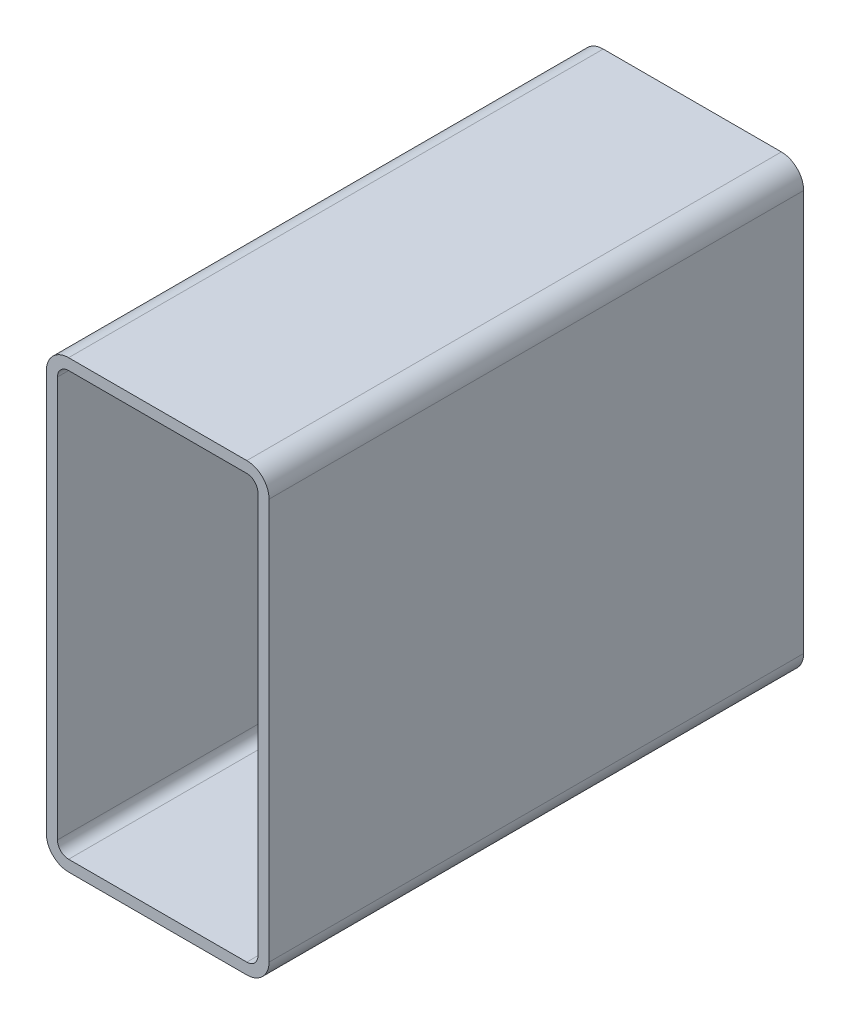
ISO-10303-21;
HEADER;
FILE_DESCRIPTION(('STEP AP214'),'2;1');
FILE_NAME('part.step','',(''),(''),'','','');
FILE_SCHEMA(('AUTOMOTIVE_DESIGN { 1 0 10303 214 1 1 1 1 }'));
ENDSEC;
DATA;
#1=APPLICATION_CONTEXT('core data for automotive mechanical design processes');
#2=APPLICATION_PROTOCOL_DEFINITION('international standard','automotive_design',2000,#1);
#3=PRODUCT_CONTEXT('',#1,'mechanical');
#4=PRODUCT('Part','Part','',(#3));
#5=PRODUCT_RELATED_PRODUCT_CATEGORY('part','',(#4));
#6=PRODUCT_DEFINITION_FORMATION('','',#4);
#7=PRODUCT_DEFINITION_CONTEXT('part definition',#1,'design');
#8=PRODUCT_DEFINITION('design','',#6,#7);
#9=PRODUCT_DEFINITION_SHAPE('','',#8);
#10=(LENGTH_UNIT() NAMED_UNIT(*) SI_UNIT(.MILLI.,.METRE.));
#11=(NAMED_UNIT(*) PLANE_ANGLE_UNIT() SI_UNIT($,.RADIAN.));
#12=(NAMED_UNIT(*) SI_UNIT($,.STERADIAN.) SOLID_ANGLE_UNIT());
#13=UNCERTAINTY_MEASURE_WITH_UNIT(LENGTH_MEASURE(1.E-05),#10,'distance_accuracy_value','');
#14=(GEOMETRIC_REPRESENTATION_CONTEXT(3) GLOBAL_UNCERTAINTY_ASSIGNED_CONTEXT((#13)) GLOBAL_UNIT_ASSIGNED_CONTEXT((#10,
#11,#12)) REPRESENTATION_CONTEXT('',''));
#15=CARTESIAN_POINT('',(0.,0.,0.));
#16=DIRECTION('',(0.,0.,1.));
#17=DIRECTION('',(1.,0.,0.));
#18=AXIS2_PLACEMENT_3D('',#15,#16,#17);
#19=CARTESIAN_POINT('',(13.5612396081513,243.220313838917,304.8));
#20=DIRECTION('',(0.,0.,1.));
#21=DIRECTION('',(1.,0.,0.));
#22=AXIS2_PLACEMENT_3D('',#19,#20,#21);
#23=PLANE('',#22);
#24=CARTESIAN_POINT('',(13.5612396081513,243.220313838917,304.8));
#25=DIRECTION('',(0.,0.,1.));
#26=DIRECTION('',(1.,0.,0.));
#27=AXIS2_PLACEMENT_3D('',#24,#25,#26);
#28=CIRCLE('',#27,12.7);
#29=CARTESIAN_POINT('',(13.5612396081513,255.920313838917,304.8));
#30=VERTEX_POINT('',#29);
#31=CARTESIAN_POINT('',(0.8612396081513,243.220313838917,304.8));
#32=VERTEX_POINT('',#31);
#33=EDGE_CURVE('E211',#30,#32,#28,.T.);
#34=ORIENTED_EDGE('',*,*,#33,.T.);
#35=DIRECTION('',(0.,-1.,0.));
#36=VECTOR('',#35,1.);
#37=CARTESIAN_POINT('',(0.8612396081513,14.6203138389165,304.8));
#38=LINE('',#37,#36);
#39=CARTESIAN_POINT('',(0.861239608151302,14.6203138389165,304.8));
#40=VERTEX_POINT('',#39);
#41=EDGE_CURVE('E214',#32,#40,#38,.T.);
#42=ORIENTED_EDGE('',*,*,#41,.T.);
#43=CARTESIAN_POINT('',(13.5612396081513,14.6203138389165,304.8));
#44=DIRECTION('',(0.,0.,1.));
#45=DIRECTION('',(1.,0.,0.));
#46=AXIS2_PLACEMENT_3D('',#43,#44,#45);
#47=CIRCLE('',#46,12.7);
#48=CARTESIAN_POINT('',(13.5612396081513,1.92031383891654,304.8));
#49=VERTEX_POINT('',#48);
#50=EDGE_CURVE('E217',#40,#49,#47,.T.);
#51=ORIENTED_EDGE('',*,*,#50,.T.);
#52=DIRECTION('',(1.,0.,0.));
#53=VECTOR('',#52,1.);
#54=CARTESIAN_POINT('',(115.161239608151,1.92031383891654,304.8));
#55=LINE('',#54,#53);
#56=CARTESIAN_POINT('',(115.161239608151,1.92031383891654,304.8));
#57=VERTEX_POINT('',#56);
#58=EDGE_CURVE('E219',#49,#57,#55,.T.);
#59=ORIENTED_EDGE('',*,*,#58,.T.);
#60=CARTESIAN_POINT('',(115.161239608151,14.6203138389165,304.8));
#61=DIRECTION('',(0.,0.,1.));
#62=DIRECTION('',(1.,0.,0.));
#63=AXIS2_PLACEMENT_3D('',#60,#61,#62);
#64=CIRCLE('',#63,12.7);
#65=CARTESIAN_POINT('',(127.861239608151,14.6203138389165,304.8));
#66=VERTEX_POINT('',#65);
#67=EDGE_CURVE('E221',#57,#66,#64,.T.);
#68=ORIENTED_EDGE('',*,*,#67,.T.);
#69=DIRECTION('',(0.,1.,0.));
#70=VECTOR('',#69,1.);
#71=CARTESIAN_POINT('',(127.861239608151,243.220313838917,304.8));
#72=LINE('',#71,#70);
#73=CARTESIAN_POINT('',(127.861239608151,243.220313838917,304.8));
#74=VERTEX_POINT('',#73);
#75=EDGE_CURVE('E223',#66,#74,#72,.T.);
#76=ORIENTED_EDGE('',*,*,#75,.T.);
#77=CARTESIAN_POINT('',(115.161239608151,243.220313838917,304.8));
#78=DIRECTION('',(0.,0.,1.));
#79=DIRECTION('',(1.,0.,0.));
#80=AXIS2_PLACEMENT_3D('',#77,#78,#79);
#81=CIRCLE('',#80,12.7);
#82=CARTESIAN_POINT('',(115.161239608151,255.920313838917,304.8));
#83=VERTEX_POINT('',#82);
#84=EDGE_CURVE('E225',#74,#83,#81,.T.);
#85=ORIENTED_EDGE('',*,*,#84,.T.);
#86=DIRECTION('',(-1.,0.,0.));
#87=VECTOR('',#86,1.);
#88=CARTESIAN_POINT('',(13.5612396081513,255.920313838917,304.8));
#89=LINE('',#88,#87);
#90=EDGE_CURVE('E227',#83,#30,#89,.T.);
#91=ORIENTED_EDGE('',*,*,#90,.T.);
#92=EDGE_LOOP('',(#34,#42,#51,#59,#68,#76,#85,#91));
#93=FACE_BOUND('',#92,.T.);
#94=DIRECTION('',(0.,-1.,0.));
#95=VECTOR('',#94,1.);
#96=CARTESIAN_POINT('',(7.2112396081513,14.6203138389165,304.8));
#97=LINE('',#96,#95);
#98=CARTESIAN_POINT('',(7.2112396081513,243.220313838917,304.8));
#99=VERTEX_POINT('',#98);
#100=CARTESIAN_POINT('',(7.2112396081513,14.6203138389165,304.8));
#101=VERTEX_POINT('',#100);
#102=EDGE_CURVE('E154',#99,#101,#97,.T.);
#103=ORIENTED_EDGE('',*,*,#102,.F.);
#104=CARTESIAN_POINT('',(13.5612396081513,243.220313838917,304.8));
#105=DIRECTION('',(0.,0.,1.));
#106=DIRECTION('',(1.,0.,0.));
#107=AXIS2_PLACEMENT_3D('',#104,#105,#106);
#108=CIRCLE('',#107,6.35000000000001);
#109=CARTESIAN_POINT('',(13.5612396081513,249.570313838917,304.8));
#110=VERTEX_POINT('',#109);
#111=EDGE_CURVE('E146',#110,#99,#108,.T.);
#112=ORIENTED_EDGE('',*,*,#111,.F.);
#113=DIRECTION('',(-1.,0.,0.));
#114=VECTOR('',#113,1.);
#115=CARTESIAN_POINT('',(13.5612396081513,249.570313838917,304.8));
#116=LINE('',#115,#114);
#117=CARTESIAN_POINT('',(115.161239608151,249.570313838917,304.8));
#118=VERTEX_POINT('',#117);
#119=EDGE_CURVE('E179',#118,#110,#116,.T.);
#120=ORIENTED_EDGE('',*,*,#119,.F.);
#121=CARTESIAN_POINT('',(115.161239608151,243.220313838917,304.8));
#122=DIRECTION('',(0.,0.,1.));
#123=DIRECTION('',(1.,0.,0.));
#124=AXIS2_PLACEMENT_3D('',#121,#122,#123);
#125=CIRCLE('',#124,6.35000000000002);
#126=CARTESIAN_POINT('',(121.511239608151,243.220313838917,304.8));
#127=VERTEX_POINT('',#126);
#128=EDGE_CURVE('E177',#127,#118,#125,.T.);
#129=ORIENTED_EDGE('',*,*,#128,.F.);
#130=DIRECTION('',(0.,1.,0.));
#131=VECTOR('',#130,1.);
#132=CARTESIAN_POINT('',(121.511239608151,243.220313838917,304.8));
#133=LINE('',#132,#131);
#134=CARTESIAN_POINT('',(121.511239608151,14.6203138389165,304.8));
#135=VERTEX_POINT('',#134);
#136=EDGE_CURVE('E175',#135,#127,#133,.T.);
#137=ORIENTED_EDGE('',*,*,#136,.F.);
#138=CARTESIAN_POINT('',(115.161239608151,14.6203138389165,304.8));
#139=DIRECTION('',(0.,0.,1.));
#140=DIRECTION('',(1.,0.,0.));
#141=AXIS2_PLACEMENT_3D('',#138,#139,#140);
#142=CIRCLE('',#141,6.35000000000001);
#143=CARTESIAN_POINT('',(115.161239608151,8.27031383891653,304.8));
#144=VERTEX_POINT('',#143);
#145=EDGE_CURVE('E173',#144,#135,#142,.T.);
#146=ORIENTED_EDGE('',*,*,#145,.F.);
#147=DIRECTION('',(1.,0.,0.));
#148=VECTOR('',#147,1.);
#149=CARTESIAN_POINT('',(115.161239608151,8.27031383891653,304.8));
#150=LINE('',#149,#148);
#151=CARTESIAN_POINT('',(13.5612396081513,8.27031383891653,304.8));
#152=VERTEX_POINT('',#151);
#153=EDGE_CURVE('E169',#152,#144,#150,.T.);
#154=ORIENTED_EDGE('',*,*,#153,.F.);
#155=CARTESIAN_POINT('',(13.5612396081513,14.6203138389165,304.8));
#156=DIRECTION('',(0.,0.,1.));
#157=DIRECTION('',(1.,0.,0.));
#158=AXIS2_PLACEMENT_3D('',#155,#156,#157);
#159=CIRCLE('',#158,6.35);
#160=EDGE_CURVE('E167',#101,#152,#159,.T.);
#161=ORIENTED_EDGE('',*,*,#160,.F.);
#162=EDGE_LOOP('',(#103,#112,#120,#129,#137,#146,#154,#161));
#163=FACE_BOUND('',#162,.T.);
#164=ADVANCED_FACE('F33',(#93,#163),#23,.T.);
#165=CARTESIAN_POINT('',(13.5612396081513,243.220313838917,0.));
#166=DIRECTION('',(0.,0.,1.));
#167=DIRECTION('',(1.,0.,0.));
#168=AXIS2_PLACEMENT_3D('',#165,#166,#167);
#169=PLANE('',#168);
#170=CARTESIAN_POINT('',(13.5612396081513,243.220313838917,0.));
#171=DIRECTION('',(0.,0.,1.));
#172=DIRECTION('',(1.,0.,0.));
#173=AXIS2_PLACEMENT_3D('',#170,#171,#172);
#174=CIRCLE('',#173,12.7);
#175=CARTESIAN_POINT('',(13.5612396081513,255.920313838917,0.));
#176=VERTEX_POINT('',#175);
#177=CARTESIAN_POINT('',(0.8612396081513,243.220313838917,0.));
#178=VERTEX_POINT('',#177);
#179=EDGE_CURVE('E162',#176,#178,#174,.T.);
#180=ORIENTED_EDGE('',*,*,#179,.F.);
#181=DIRECTION('',(-1.,0.,0.));
#182=VECTOR('',#181,1.);
#183=CARTESIAN_POINT('',(13.5612396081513,255.920313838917,0.));
#184=LINE('',#183,#182);
#185=CARTESIAN_POINT('',(115.161239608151,255.920313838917,0.));
#186=VERTEX_POINT('',#185);
#187=EDGE_CURVE('E215',#186,#176,#184,.T.);
#188=ORIENTED_EDGE('',*,*,#187,.F.);
#189=CARTESIAN_POINT('',(115.161239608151,243.220313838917,0.));
#190=DIRECTION('',(0.,0.,1.));
#191=DIRECTION('',(1.,0.,0.));
#192=AXIS2_PLACEMENT_3D('',#189,#190,#191);
#193=CIRCLE('',#192,12.7);
#194=CARTESIAN_POINT('',(127.861239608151,243.220313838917,0.));
#195=VERTEX_POINT('',#194);
#196=EDGE_CURVE('E242',#195,#186,#193,.T.);
#197=ORIENTED_EDGE('',*,*,#196,.F.);
#198=DIRECTION('',(0.,1.,0.));
#199=VECTOR('',#198,1.);
#200=CARTESIAN_POINT('',(127.861239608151,243.220313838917,0.));
#201=LINE('',#200,#199);
#202=CARTESIAN_POINT('',(127.861239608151,14.6203138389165,0.));
#203=VERTEX_POINT('',#202);
#204=EDGE_CURVE('E240',#203,#195,#201,.T.);
#205=ORIENTED_EDGE('',*,*,#204,.F.);
#206=CARTESIAN_POINT('',(115.161239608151,14.6203138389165,0.));
#207=DIRECTION('',(0.,0.,1.));
#208=DIRECTION('',(1.,0.,0.));
#209=AXIS2_PLACEMENT_3D('',#206,#207,#208);
#210=CIRCLE('',#209,12.7);
#211=CARTESIAN_POINT('',(115.161239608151,1.92031383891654,0.));
#212=VERTEX_POINT('',#211);
#213=EDGE_CURVE('E238',#212,#203,#210,.T.);
#214=ORIENTED_EDGE('',*,*,#213,.F.);
#215=DIRECTION('',(1.,0.,0.));
#216=VECTOR('',#215,1.);
#217=CARTESIAN_POINT('',(115.161239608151,1.92031383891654,0.));
#218=LINE('',#217,#216);
#219=CARTESIAN_POINT('',(13.5612396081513,1.92031383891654,0.));
#220=VERTEX_POINT('',#219);
#221=EDGE_CURVE('E236',#220,#212,#218,.T.);
#222=ORIENTED_EDGE('',*,*,#221,.F.);
#223=CARTESIAN_POINT('',(13.5612396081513,14.6203138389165,0.));
#224=DIRECTION('',(0.,0.,1.));
#225=DIRECTION('',(1.,0.,0.));
#226=AXIS2_PLACEMENT_3D('',#223,#224,#225);
#227=CIRCLE('',#226,12.7);
#228=CARTESIAN_POINT('',(0.861239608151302,14.6203138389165,0.));
#229=VERTEX_POINT('',#228);
#230=EDGE_CURVE('E234',#229,#220,#227,.T.);
#231=ORIENTED_EDGE('',*,*,#230,.F.);
#232=DIRECTION('',(0.,-1.,0.));
#233=VECTOR('',#232,1.);
#234=CARTESIAN_POINT('',(0.8612396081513,14.6203138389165,0.));
#235=LINE('',#234,#233);
#236=EDGE_CURVE('E232',#178,#229,#235,.T.);
#237=ORIENTED_EDGE('',*,*,#236,.F.);
#238=EDGE_LOOP('',(#180,#188,#197,#205,#214,#222,#231,#237));
#239=FACE_BOUND('',#238,.T.);
#240=CARTESIAN_POINT('',(13.5612396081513,243.220313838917,0.));
#241=DIRECTION('',(0.,0.,1.));
#242=DIRECTION('',(1.,0.,0.));
#243=AXIS2_PLACEMENT_3D('',#240,#241,#242);
#244=CIRCLE('',#243,6.35000000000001);
#245=CARTESIAN_POINT('',(13.5612396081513,249.570313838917,0.));
#246=VERTEX_POINT('',#245);
#247=CARTESIAN_POINT('',(7.2112396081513,243.220313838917,0.));
#248=VERTEX_POINT('',#247);
#249=EDGE_CURVE('E56',#246,#248,#244,.T.);
#250=ORIENTED_EDGE('',*,*,#249,.T.);
#251=DIRECTION('',(0.,-1.,0.));
#252=VECTOR('',#251,1.);
#253=CARTESIAN_POINT('',(7.2112396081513,14.6203138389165,0.));
#254=LINE('',#253,#252);
#255=CARTESIAN_POINT('',(7.2112396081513,14.6203138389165,0.));
#256=VERTEX_POINT('',#255);
#257=EDGE_CURVE('E161',#248,#256,#254,.T.);
#258=ORIENTED_EDGE('',*,*,#257,.T.);
#259=CARTESIAN_POINT('',(13.5612396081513,14.6203138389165,0.));
#260=DIRECTION('',(0.,0.,1.));
#261=DIRECTION('',(1.,0.,0.));
#262=AXIS2_PLACEMENT_3D('',#259,#260,#261);
#263=CIRCLE('',#262,6.35);
#264=CARTESIAN_POINT('',(13.5612396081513,8.27031383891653,0.));
#265=VERTEX_POINT('',#264);
#266=EDGE_CURVE('E183',#256,#265,#263,.T.);
#267=ORIENTED_EDGE('',*,*,#266,.T.);
#268=DIRECTION('',(1.,0.,0.));
#269=VECTOR('',#268,1.);
#270=CARTESIAN_POINT('',(115.161239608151,8.27031383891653,0.));
#271=LINE('',#270,#269);
#272=CARTESIAN_POINT('',(115.161239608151,8.27031383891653,0.));
#273=VERTEX_POINT('',#272);
#274=EDGE_CURVE('E186',#265,#273,#271,.T.);
#275=ORIENTED_EDGE('',*,*,#274,.T.);
#276=CARTESIAN_POINT('',(115.161239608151,14.6203138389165,0.));
#277=DIRECTION('',(0.,0.,1.));
#278=DIRECTION('',(1.,0.,0.));
#279=AXIS2_PLACEMENT_3D('',#276,#277,#278);
#280=CIRCLE('',#279,6.35000000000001);
#281=CARTESIAN_POINT('',(121.511239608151,14.6203138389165,0.));
#282=VERTEX_POINT('',#281);
#283=EDGE_CURVE('E189',#273,#282,#280,.T.);
#284=ORIENTED_EDGE('',*,*,#283,.T.);
#285=DIRECTION('',(0.,1.,0.));
#286=VECTOR('',#285,1.);
#287=CARTESIAN_POINT('',(121.511239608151,243.220313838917,0.));
#288=LINE('',#287,#286);
#289=CARTESIAN_POINT('',(121.511239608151,243.220313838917,0.));
#290=VERTEX_POINT('',#289);
#291=EDGE_CURVE('E192',#282,#290,#288,.T.);
#292=ORIENTED_EDGE('',*,*,#291,.T.);
#293=CARTESIAN_POINT('',(115.161239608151,243.220313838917,0.));
#294=DIRECTION('',(0.,0.,1.));
#295=DIRECTION('',(1.,0.,0.));
#296=AXIS2_PLACEMENT_3D('',#293,#294,#295);
#297=CIRCLE('',#296,6.35000000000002);
#298=CARTESIAN_POINT('',(115.161239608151,249.570313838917,0.));
#299=VERTEX_POINT('',#298);
#300=EDGE_CURVE('E195',#290,#299,#297,.T.);
#301=ORIENTED_EDGE('',*,*,#300,.T.);
#302=DIRECTION('',(-1.,0.,0.));
#303=VECTOR('',#302,1.);
#304=CARTESIAN_POINT('',(13.5612396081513,249.570313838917,0.));
#305=LINE('',#304,#303);
#306=EDGE_CURVE('E155',#299,#246,#305,.T.);
#307=ORIENTED_EDGE('',*,*,#306,.T.);
#308=EDGE_LOOP('',(#250,#258,#267,#275,#284,#292,#301,#307));
#309=FACE_BOUND('',#308,.T.);
#310=ADVANCED_FACE('F272',(#239,#309),#169,.F.);
#311=CARTESIAN_POINT('',(13.5612396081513,243.220313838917,304.8));
#312=DIRECTION('',(0.,0.,-1.));
#313=DIRECTION('',(-1.,0.,0.));
#314=AXIS2_PLACEMENT_3D('',#311,#312,#313);
#315=CYLINDRICAL_SURFACE('',#314,12.7);
#316=ORIENTED_EDGE('',*,*,#179,.T.);
#317=DIRECTION('',(0.,0.,-1.));
#318=VECTOR('',#317,1.);
#319=CARTESIAN_POINT('',(0.8612396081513,243.220313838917,304.8));
#320=LINE('',#319,#318);
#321=EDGE_CURVE('E11',#32,#178,#320,.T.);
#322=ORIENTED_EDGE('',*,*,#321,.F.);
#323=ORIENTED_EDGE('',*,*,#33,.F.);
#324=DIRECTION('',(0.,0.,-1.));
#325=VECTOR('',#324,1.);
#326=CARTESIAN_POINT('',(13.5612396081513,255.920313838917,304.8));
#327=LINE('',#326,#325);
#328=EDGE_CURVE('E229',#30,#176,#327,.T.);
#329=ORIENTED_EDGE('',*,*,#328,.T.);
#330=EDGE_LOOP('',(#316,#322,#323,#329));
#331=FACE_BOUND('',#330,.T.);
#332=ADVANCED_FACE('F35',(#331),#315,.T.);
#333=CARTESIAN_POINT('',(0.8612396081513,14.6203138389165,304.8));
#334=DIRECTION('',(1.,0.,0.));
#335=DIRECTION('',(0.,0.,-1.));
#336=AXIS2_PLACEMENT_3D('',#333,#334,#335);
#337=PLANE('',#336);
#338=ORIENTED_EDGE('',*,*,#236,.T.);
#339=DIRECTION('',(0.,0.,-1.));
#340=VECTOR('',#339,1.);
#341=CARTESIAN_POINT('',(0.861239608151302,14.6203138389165,304.8));
#342=LINE('',#341,#340);
#343=EDGE_CURVE('E41',#40,#229,#342,.T.);
#344=ORIENTED_EDGE('',*,*,#343,.F.);
#345=ORIENTED_EDGE('',*,*,#41,.F.);
#346=ORIENTED_EDGE('',*,*,#321,.T.);
#347=EDGE_LOOP('',(#338,#344,#345,#346));
#348=FACE_BOUND('',#347,.T.);
#349=ADVANCED_FACE('F289',(#348),#337,.F.);
#350=CARTESIAN_POINT('',(13.5612396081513,14.6203138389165,304.8));
#351=DIRECTION('',(0.,0.,-1.));
#352=DIRECTION('',(-1.,0.,0.));
#353=AXIS2_PLACEMENT_3D('',#350,#351,#352);
#354=CYLINDRICAL_SURFACE('',#353,12.7);
#355=ORIENTED_EDGE('',*,*,#230,.T.);
#356=DIRECTION('',(0.,0.,-1.));
#357=VECTOR('',#356,1.);
#358=CARTESIAN_POINT('',(13.5612396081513,1.92031383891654,304.8));
#359=LINE('',#358,#357);
#360=EDGE_CURVE('E259',#49,#220,#359,.T.);
#361=ORIENTED_EDGE('',*,*,#360,.F.);
#362=ORIENTED_EDGE('',*,*,#50,.F.);
#363=ORIENTED_EDGE('',*,*,#343,.T.);
#364=EDGE_LOOP('',(#355,#361,#362,#363));
#365=FACE_BOUND('',#364,.T.);
#366=ADVANCED_FACE('F266',(#365),#354,.T.);
#367=CARTESIAN_POINT('',(115.161239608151,1.92031383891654,304.8));
#368=DIRECTION('',(0.,1.,0.));
#369=DIRECTION('',(0.,0.,1.));
#370=AXIS2_PLACEMENT_3D('',#367,#368,#369);
#371=PLANE('',#370);
#372=ORIENTED_EDGE('',*,*,#221,.T.);
#373=DIRECTION('',(0.,0.,-1.));
#374=VECTOR('',#373,1.);
#375=CARTESIAN_POINT('',(115.161239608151,1.92031383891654,304.8));
#376=LINE('',#375,#374);
#377=EDGE_CURVE('E256',#57,#212,#376,.T.);
#378=ORIENTED_EDGE('',*,*,#377,.F.);
#379=ORIENTED_EDGE('',*,*,#58,.F.);
#380=ORIENTED_EDGE('',*,*,#360,.T.);
#381=EDGE_LOOP('',(#372,#378,#379,#380));
#382=FACE_BOUND('',#381,.T.);
#383=ADVANCED_FACE('F278',(#382),#371,.F.);
#384=CARTESIAN_POINT('',(115.161239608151,14.6203138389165,304.8));
#385=DIRECTION('',(0.,0.,-1.));
#386=DIRECTION('',(-1.,0.,0.));
#387=AXIS2_PLACEMENT_3D('',#384,#385,#386);
#388=CYLINDRICAL_SURFACE('',#387,12.7);
#389=ORIENTED_EDGE('',*,*,#213,.T.);
#390=DIRECTION('',(0.,0.,-1.));
#391=VECTOR('',#390,1.);
#392=CARTESIAN_POINT('',(127.861239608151,14.6203138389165,304.8));
#393=LINE('',#392,#391);
#394=EDGE_CURVE('E253',#66,#203,#393,.T.);
#395=ORIENTED_EDGE('',*,*,#394,.F.);
#396=ORIENTED_EDGE('',*,*,#67,.F.);
#397=ORIENTED_EDGE('',*,*,#377,.T.);
#398=EDGE_LOOP('',(#389,#395,#396,#397));
#399=FACE_BOUND('',#398,.T.);
#400=ADVANCED_FACE('F282',(#399),#388,.T.);
#401=CARTESIAN_POINT('',(127.861239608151,243.220313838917,304.8));
#402=DIRECTION('',(-1.,0.,0.));
#403=DIRECTION('',(0.,0.,1.));
#404=AXIS2_PLACEMENT_3D('',#401,#402,#403);
#405=PLANE('',#404);
#406=ORIENTED_EDGE('',*,*,#204,.T.);
#407=DIRECTION('',(0.,0.,-1.));
#408=VECTOR('',#407,1.);
#409=CARTESIAN_POINT('',(127.861239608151,243.220313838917,304.8));
#410=LINE('',#409,#408);
#411=EDGE_CURVE('E250',#74,#195,#410,.T.);
#412=ORIENTED_EDGE('',*,*,#411,.F.);
#413=ORIENTED_EDGE('',*,*,#75,.F.);
#414=ORIENTED_EDGE('',*,*,#394,.T.);
#415=EDGE_LOOP('',(#406,#412,#413,#414));
#416=FACE_BOUND('',#415,.T.);
#417=ADVANCED_FACE('F302',(#416),#405,.F.);
#418=CARTESIAN_POINT('',(115.161239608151,243.220313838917,304.8));
#419=DIRECTION('',(0.,0.,-1.));
#420=DIRECTION('',(-1.,0.,0.));
#421=AXIS2_PLACEMENT_3D('',#418,#419,#420);
#422=CYLINDRICAL_SURFACE('',#421,12.7);
#423=ORIENTED_EDGE('',*,*,#196,.T.);
#424=DIRECTION('',(0.,0.,-1.));
#425=VECTOR('',#424,1.);
#426=CARTESIAN_POINT('',(115.161239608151,255.920313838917,304.8));
#427=LINE('',#426,#425);
#428=EDGE_CURVE('E247',#83,#186,#427,.T.);
#429=ORIENTED_EDGE('',*,*,#428,.F.);
#430=ORIENTED_EDGE('',*,*,#84,.F.);
#431=ORIENTED_EDGE('',*,*,#411,.T.);
#432=EDGE_LOOP('',(#423,#429,#430,#431));
#433=FACE_BOUND('',#432,.T.);
#434=ADVANCED_FACE('F300',(#433),#422,.T.);
#435=CARTESIAN_POINT('',(13.5612396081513,255.920313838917,304.8));
#436=DIRECTION('',(0.,-1.,0.));
#437=DIRECTION('',(0.,0.,-1.));
#438=AXIS2_PLACEMENT_3D('',#435,#436,#437);
#439=PLANE('',#438);
#440=ORIENTED_EDGE('',*,*,#187,.T.);
#441=ORIENTED_EDGE('',*,*,#328,.F.);
#442=ORIENTED_EDGE('',*,*,#90,.F.);
#443=ORIENTED_EDGE('',*,*,#428,.T.);
#444=EDGE_LOOP('',(#440,#441,#442,#443));
#445=FACE_BOUND('',#444,.T.);
#446=ADVANCED_FACE('F295',(#445),#439,.F.);
#447=CARTESIAN_POINT('',(13.5612396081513,243.220313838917,304.8));
#448=DIRECTION('',(0.,0.,-1.));
#449=DIRECTION('',(-1.,0.,0.));
#450=AXIS2_PLACEMENT_3D('',#447,#448,#449);
#451=CYLINDRICAL_SURFACE('',#450,6.35000000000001);
#452=ORIENTED_EDGE('',*,*,#249,.F.);
#453=DIRECTION('',(0.,0.,-1.));
#454=VECTOR('',#453,1.);
#455=CARTESIAN_POINT('',(13.5612396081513,249.570313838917,304.8));
#456=LINE('',#455,#454);
#457=EDGE_CURVE('E150',#110,#246,#456,.T.);
#458=ORIENTED_EDGE('',*,*,#457,.F.);
#459=ORIENTED_EDGE('',*,*,#111,.T.);
#460=DIRECTION('',(0.,0.,-1.));
#461=VECTOR('',#460,1.);
#462=CARTESIAN_POINT('',(7.2112396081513,243.220313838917,304.8));
#463=LINE('',#462,#461);
#464=EDGE_CURVE('E149',#99,#248,#463,.T.);
#465=ORIENTED_EDGE('',*,*,#464,.T.);
#466=EDGE_LOOP('',(#452,#458,#459,#465));
#467=FACE_BOUND('',#466,.T.);
#468=ADVANCED_FACE('F148',(#467),#451,.F.);
#469=CARTESIAN_POINT('',(7.2112396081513,14.6203138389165,304.8));
#470=DIRECTION('',(1.,0.,0.));
#471=DIRECTION('',(0.,0.,-1.));
#472=AXIS2_PLACEMENT_3D('',#469,#470,#471);
#473=PLANE('',#472);
#474=ORIENTED_EDGE('',*,*,#257,.F.);
#475=ORIENTED_EDGE('',*,*,#464,.F.);
#476=ORIENTED_EDGE('',*,*,#102,.T.);
#477=DIRECTION('',(0.,0.,-1.));
#478=VECTOR('',#477,1.);
#479=CARTESIAN_POINT('',(7.2112396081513,14.6203138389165,304.8));
#480=LINE('',#479,#478);
#481=EDGE_CURVE('E163',#101,#256,#480,.T.);
#482=ORIENTED_EDGE('',*,*,#481,.T.);
#483=EDGE_LOOP('',(#474,#475,#476,#482));
#484=FACE_BOUND('',#483,.T.);
#485=ADVANCED_FACE('F158',(#484),#473,.T.);
#486=CARTESIAN_POINT('',(13.5612396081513,14.6203138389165,304.8));
#487=DIRECTION('',(0.,0.,-1.));
#488=DIRECTION('',(-1.,0.,0.));
#489=AXIS2_PLACEMENT_3D('',#486,#487,#488);
#490=CYLINDRICAL_SURFACE('',#489,6.35);
#491=ORIENTED_EDGE('',*,*,#266,.F.);
#492=ORIENTED_EDGE('',*,*,#481,.F.);
#493=ORIENTED_EDGE('',*,*,#160,.T.);
#494=DIRECTION('',(0.,0.,-1.));
#495=VECTOR('',#494,1.);
#496=CARTESIAN_POINT('',(13.5612396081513,8.27031383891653,304.8));
#497=LINE('',#496,#495);
#498=EDGE_CURVE('E208',#152,#265,#497,.T.);
#499=ORIENTED_EDGE('',*,*,#498,.T.);
#500=EDGE_LOOP('',(#491,#492,#493,#499));
#501=FACE_BOUND('',#500,.T.);
#502=ADVANCED_FACE('F327',(#501),#490,.F.);
#503=CARTESIAN_POINT('',(115.161239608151,8.27031383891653,304.8));
#504=DIRECTION('',(0.,1.,0.));
#505=DIRECTION('',(0.,0.,1.));
#506=AXIS2_PLACEMENT_3D('',#503,#504,#505);
#507=PLANE('',#506);
#508=ORIENTED_EDGE('',*,*,#274,.F.);
#509=ORIENTED_EDGE('',*,*,#498,.F.);
#510=ORIENTED_EDGE('',*,*,#153,.T.);
#511=DIRECTION('',(0.,0.,-1.));
#512=VECTOR('',#511,1.);
#513=CARTESIAN_POINT('',(115.161239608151,8.27031383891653,304.8));
#514=LINE('',#513,#512);
#515=EDGE_CURVE('E206',#144,#273,#514,.T.);
#516=ORIENTED_EDGE('',*,*,#515,.T.);
#517=EDGE_LOOP('',(#508,#509,#510,#516));
#518=FACE_BOUND('',#517,.T.);
#519=ADVANCED_FACE('F331',(#518),#507,.T.);
#520=CARTESIAN_POINT('',(115.161239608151,14.6203138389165,304.8));
#521=DIRECTION('',(0.,0.,-1.));
#522=DIRECTION('',(-1.,0.,0.));
#523=AXIS2_PLACEMENT_3D('',#520,#521,#522);
#524=CYLINDRICAL_SURFACE('',#523,6.35000000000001);
#525=ORIENTED_EDGE('',*,*,#283,.F.);
#526=ORIENTED_EDGE('',*,*,#515,.F.);
#527=ORIENTED_EDGE('',*,*,#145,.T.);
#528=DIRECTION('',(0.,0.,-1.));
#529=VECTOR('',#528,1.);
#530=CARTESIAN_POINT('',(121.511239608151,14.6203138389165,304.8));
#531=LINE('',#530,#529);
#532=EDGE_CURVE('E204',#135,#282,#531,.T.);
#533=ORIENTED_EDGE('',*,*,#532,.T.);
#534=EDGE_LOOP('',(#525,#526,#527,#533));
#535=FACE_BOUND('',#534,.T.);
#536=ADVANCED_FACE('F337',(#535),#524,.F.);
#537=CARTESIAN_POINT('',(121.511239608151,243.220313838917,304.8));
#538=DIRECTION('',(-1.,0.,0.));
#539=DIRECTION('',(0.,0.,1.));
#540=AXIS2_PLACEMENT_3D('',#537,#538,#539);
#541=PLANE('',#540);
#542=ORIENTED_EDGE('',*,*,#291,.F.);
#543=ORIENTED_EDGE('',*,*,#532,.F.);
#544=ORIENTED_EDGE('',*,*,#136,.T.);
#545=DIRECTION('',(0.,0.,-1.));
#546=VECTOR('',#545,1.);
#547=CARTESIAN_POINT('',(121.511239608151,243.220313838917,304.8));
#548=LINE('',#547,#546);
#549=EDGE_CURVE('E202',#127,#290,#548,.T.);
#550=ORIENTED_EDGE('',*,*,#549,.T.);
#551=EDGE_LOOP('',(#542,#543,#544,#550));
#552=FACE_BOUND('',#551,.T.);
#553=ADVANCED_FACE('F341',(#552),#541,.T.);
#554=CARTESIAN_POINT('',(115.161239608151,243.220313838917,304.8));
#555=DIRECTION('',(0.,0.,-1.));
#556=DIRECTION('',(-1.,0.,0.));
#557=AXIS2_PLACEMENT_3D('',#554,#555,#556);
#558=CYLINDRICAL_SURFACE('',#557,6.35000000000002);
#559=ORIENTED_EDGE('',*,*,#300,.F.);
#560=ORIENTED_EDGE('',*,*,#549,.F.);
#561=ORIENTED_EDGE('',*,*,#128,.T.);
#562=DIRECTION('',(0.,0.,-1.));
#563=VECTOR('',#562,1.);
#564=CARTESIAN_POINT('',(115.161239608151,249.570313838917,304.8));
#565=LINE('',#564,#563);
#566=EDGE_CURVE('E48',#118,#299,#565,.T.);
#567=ORIENTED_EDGE('',*,*,#566,.T.);
#568=EDGE_LOOP('',(#559,#560,#561,#567));
#569=FACE_BOUND('',#568,.T.);
#570=ADVANCED_FACE('F345',(#569),#558,.F.);
#571=CARTESIAN_POINT('',(13.5612396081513,249.570313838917,304.8));
#572=DIRECTION('',(0.,-1.,0.));
#573=DIRECTION('',(0.,0.,-1.));
#574=AXIS2_PLACEMENT_3D('',#571,#572,#573);
#575=PLANE('',#574);
#576=ORIENTED_EDGE('',*,*,#306,.F.);
#577=ORIENTED_EDGE('',*,*,#566,.F.);
#578=ORIENTED_EDGE('',*,*,#119,.T.);
#579=ORIENTED_EDGE('',*,*,#457,.T.);
#580=EDGE_LOOP('',(#576,#577,#578,#579));
#581=FACE_BOUND('',#580,.T.);
#582=ADVANCED_FACE('F349',(#581),#575,.T.);
#583=CLOSED_SHELL('',(#164,#310,#332,#349,#366,#383,#400,#417,#434,#446,#468,#485,#502,#519,
#536,#553,#570,#582));
#584=MANIFOLD_SOLID_BREP('B2',#583);
#585=ADVANCED_BREP_SHAPE_REPRESENTATION('',(#18,#584),#14);
#586=SHAPE_DEFINITION_REPRESENTATION(#9,#585);
ENDSEC;
END-ISO-10303-21;
